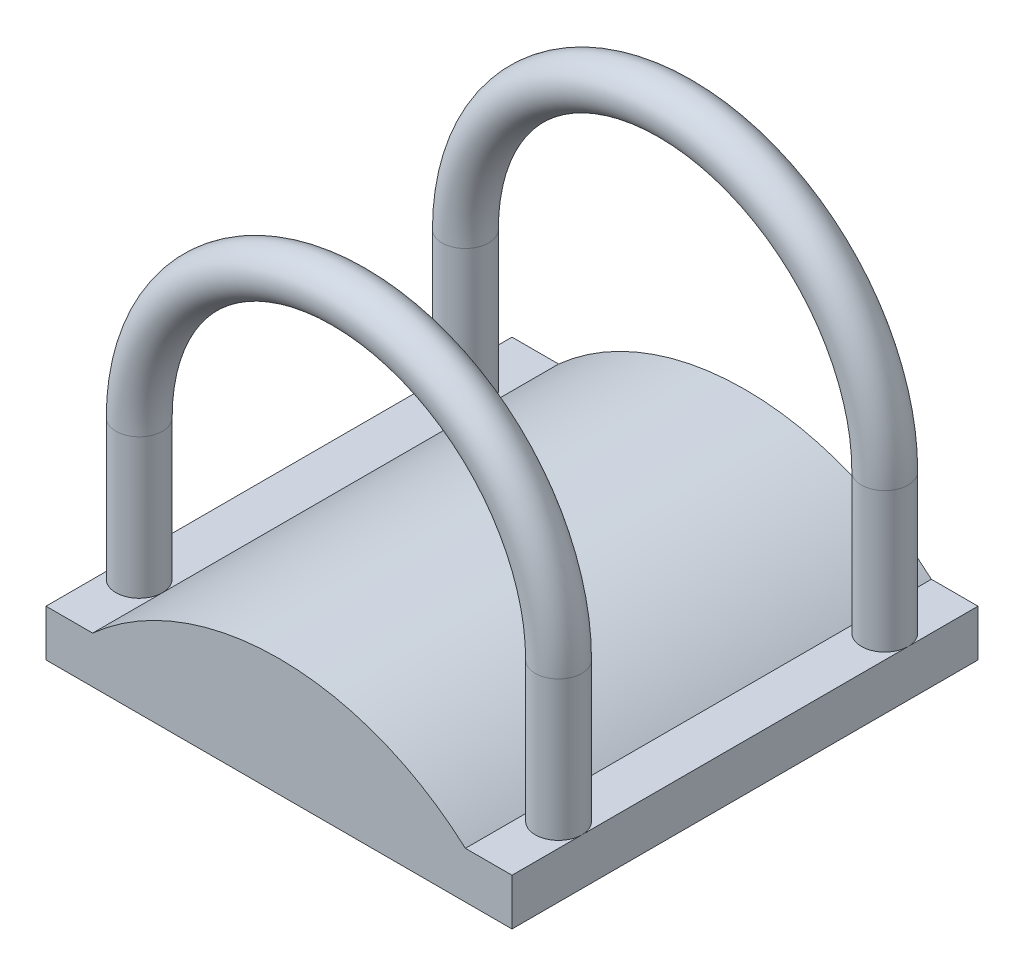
ISO-10303-21;
HEADER;
FILE_DESCRIPTION(('STEP AP214'),'2;1');
FILE_NAME('part.step','',(''),(''),'','','');
FILE_SCHEMA(('AUTOMOTIVE_DESIGN { 1 0 10303 214 1 1 1 1 }'));
ENDSEC;
DATA;
#1=APPLICATION_CONTEXT('core data for automotive mechanical design processes');
#2=APPLICATION_PROTOCOL_DEFINITION('international standard','automotive_design',2000,#1);
#3=PRODUCT_CONTEXT('',#1,'mechanical');
#4=PRODUCT('Part','Part','',(#3));
#5=PRODUCT_RELATED_PRODUCT_CATEGORY('part','',(#4));
#6=PRODUCT_DEFINITION_FORMATION('','',#4);
#7=PRODUCT_DEFINITION_CONTEXT('part definition',#1,'design');
#8=PRODUCT_DEFINITION('design','',#6,#7);
#9=PRODUCT_DEFINITION_SHAPE('','',#8);
#10=(LENGTH_UNIT() NAMED_UNIT(*) SI_UNIT(.MILLI.,.METRE.));
#11=(NAMED_UNIT(*) PLANE_ANGLE_UNIT() SI_UNIT($,.RADIAN.));
#12=(NAMED_UNIT(*) SI_UNIT($,.STERADIAN.) SOLID_ANGLE_UNIT());
#13=UNCERTAINTY_MEASURE_WITH_UNIT(LENGTH_MEASURE(1.E-05),#10,'distance_accuracy_value','');
#14=(GEOMETRIC_REPRESENTATION_CONTEXT(3) GLOBAL_UNCERTAINTY_ASSIGNED_CONTEXT((#13)) GLOBAL_UNIT_ASSIGNED_CONTEXT((#10,
#11,#12)) REPRESENTATION_CONTEXT('',''));
#15=CARTESIAN_POINT('',(0.,0.,0.));
#16=DIRECTION('',(0.,0.,1.));
#17=DIRECTION('',(1.,0.,0.));
#18=AXIS2_PLACEMENT_3D('',#15,#16,#17);
#19=CARTESIAN_POINT('',(0.,10.,50.));
#20=DIRECTION('',(0.,-1.,0.));
#21=DIRECTION('',(1.,0.,0.));
#22=AXIS2_PLACEMENT_3D('',#19,#20,#21);
#23=PLANE('',#22);
#24=CARTESIAN_POINT('',(-5.00000000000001,10.,-35.));
#25=DIRECTION('',(0.,1.,0.));
#26=DIRECTION('',(-1.,0.,0.));
#27=AXIS2_PLACEMENT_3D('',#24,#25,#26);
#28=CIRCLE('',#27,5.);
#29=CARTESIAN_POINT('',(0.,10.,-35.));
#30=VERTEX_POINT('',#29);
#31=CARTESIAN_POINT('',(-9.99999999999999,9.99999999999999,-35.));
#32=VERTEX_POINT('',#31);
#33=EDGE_CURVE('E220',#30,#32,#28,.T.);
#34=ORIENTED_EDGE('',*,*,#33,.F.);
#35=DIRECTION('',(0.,0.,-1.));
#36=VECTOR('',#35,1.);
#37=CARTESIAN_POINT('',(0.,10.,50.));
#38=LINE('',#37,#36);
#39=CARTESIAN_POINT('',(0.,10.,-50.));
#40=VERTEX_POINT('',#39);
#41=EDGE_CURVE('E42',#30,#40,#38,.T.);
#42=ORIENTED_EDGE('',*,*,#41,.T.);
#43=DIRECTION('',(-1.,0.,0.));
#44=VECTOR('',#43,1.);
#45=CARTESIAN_POINT('',(0.,10.,-50.));
#46=LINE('',#45,#44);
#47=CARTESIAN_POINT('',(-9.99999999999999,9.99999999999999,-50.));
#48=VERTEX_POINT('',#47);
#49=EDGE_CURVE('E162',#40,#48,#46,.T.);
#50=ORIENTED_EDGE('',*,*,#49,.T.);
#51=DIRECTION('',(0.,0.,-1.));
#52=VECTOR('',#51,1.);
#53=CARTESIAN_POINT('',(-9.99999999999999,9.99999999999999,50.));
#54=LINE('',#53,#52);
#55=EDGE_CURVE('E146',#32,#48,#54,.T.);
#56=ORIENTED_EDGE('',*,*,#55,.F.);
#57=EDGE_LOOP('',(#34,#42,#50,#56));
#58=FACE_BOUND('',#57,.T.);
#59=ADVANCED_FACE('F33',(#58),#23,.F.);
#60=EDGE_CURVE('E49',#32,#30,#28,.T.);
#61=ORIENTED_EDGE('',*,*,#60,.F.);
#62=CARTESIAN_POINT('',(-10.,10.,35.));
#63=VERTEX_POINT('',#62);
#64=EDGE_CURVE('E148',#63,#32,#54,.T.);
#65=ORIENTED_EDGE('',*,*,#64,.F.);
#66=CARTESIAN_POINT('',(-5.,10.,35.));
#67=DIRECTION('',(0.,1.,0.));
#68=DIRECTION('',(-1.,0.,0.));
#69=AXIS2_PLACEMENT_3D('',#66,#67,#68);
#70=CIRCLE('',#69,5.);
#71=CARTESIAN_POINT('',(0.,10.,35.));
#72=VERTEX_POINT('',#71);
#73=EDGE_CURVE('E126',#72,#63,#70,.T.);
#74=ORIENTED_EDGE('',*,*,#73,.F.);
#75=EDGE_CURVE('E41',#72,#30,#38,.T.);
#76=ORIENTED_EDGE('',*,*,#75,.T.);
#77=EDGE_LOOP('',(#61,#65,#74,#76));
#78=FACE_BOUND('',#77,.T.);
#79=ADVANCED_FACE('F234',(#78),#23,.F.);
#80=CARTESIAN_POINT('',(-100.,10.,50.));
#81=DIRECTION('',(0.,-1.,0.));
#82=DIRECTION('',(0.,0.,-1.));
#83=AXIS2_PLACEMENT_3D('',#80,#81,#82);
#84=PLANE('',#83);
#85=DIRECTION('',(0.,0.,-1.));
#86=VECTOR('',#85,1.);
#87=CARTESIAN_POINT('',(-90.,10.,50.));
#88=LINE('',#87,#86);
#89=CARTESIAN_POINT('',(-90.,10.,35.));
#90=VERTEX_POINT('',#89);
#91=CARTESIAN_POINT('',(-90.,10.,-35.));
#92=VERTEX_POINT('',#91);
#93=EDGE_CURVE('E125',#90,#92,#88,.T.);
#94=ORIENTED_EDGE('',*,*,#93,.T.);
#95=CARTESIAN_POINT('',(-95.,9.99999999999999,-35.));
#96=DIRECTION('',(0.,-1.,0.));
#97=DIRECTION('',(1.,0.,0.));
#98=AXIS2_PLACEMENT_3D('',#95,#96,#97);
#99=CIRCLE('',#98,5.);
#100=CARTESIAN_POINT('',(-100.,9.99999999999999,-35.));
#101=VERTEX_POINT('',#100);
#102=EDGE_CURVE('E56',#92,#101,#99,.T.);
#103=ORIENTED_EDGE('',*,*,#102,.T.);
#104=DIRECTION('',(0.,0.,-1.));
#105=VECTOR('',#104,1.);
#106=CARTESIAN_POINT('',(-100.,10.,50.));
#107=LINE('',#106,#105);
#108=CARTESIAN_POINT('',(-100.,9.99999999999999,35.));
#109=VERTEX_POINT('',#108);
#110=EDGE_CURVE('E122',#109,#101,#107,.T.);
#111=ORIENTED_EDGE('',*,*,#110,.F.);
#112=CARTESIAN_POINT('',(-95.,9.99999999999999,35.));
#113=DIRECTION('',(0.,-1.,0.));
#114=DIRECTION('',(1.,0.,0.));
#115=AXIS2_PLACEMENT_3D('',#112,#113,#114);
#116=CIRCLE('',#115,5.);
#117=EDGE_CURVE('E203',#109,#90,#116,.T.);
#118=ORIENTED_EDGE('',*,*,#117,.T.);
#119=EDGE_LOOP('',(#94,#103,#111,#118));
#120=FACE_BOUND('',#119,.T.);
#121=ADVANCED_FACE('F119',(#120),#84,.F.);
#122=EDGE_CURVE('E212',#63,#72,#70,.T.);
#123=ORIENTED_EDGE('',*,*,#122,.F.);
#124=CARTESIAN_POINT('',(-9.99999999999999,9.99999999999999,50.));
#125=VERTEX_POINT('',#124);
#126=EDGE_CURVE('E147',#125,#63,#54,.T.);
#127=ORIENTED_EDGE('',*,*,#126,.F.);
#128=DIRECTION('',(-1.,0.,0.));
#129=VECTOR('',#128,1.);
#130=CARTESIAN_POINT('',(0.,10.,50.));
#131=LINE('',#130,#129);
#132=CARTESIAN_POINT('',(0.,10.,50.));
#133=VERTEX_POINT('',#132);
#134=EDGE_CURVE('E181',#133,#125,#131,.T.);
#135=ORIENTED_EDGE('',*,*,#134,.F.);
#136=EDGE_CURVE('E11',#133,#72,#38,.T.);
#137=ORIENTED_EDGE('',*,*,#136,.T.);
#138=EDGE_LOOP('',(#123,#127,#135,#137));
#139=FACE_BOUND('',#138,.T.);
#140=ADVANCED_FACE('F235',(#139),#23,.F.);
#141=CARTESIAN_POINT('',(-90.,10.,50.));
#142=VERTEX_POINT('',#141);
#143=EDGE_CURVE('E144',#142,#90,#88,.T.);
#144=ORIENTED_EDGE('',*,*,#143,.T.);
#145=EDGE_CURVE('E201',#90,#109,#116,.T.);
#146=ORIENTED_EDGE('',*,*,#145,.T.);
#147=CARTESIAN_POINT('',(-100.,10.,50.));
#148=VERTEX_POINT('',#147);
#149=EDGE_CURVE('E136',#148,#109,#107,.T.);
#150=ORIENTED_EDGE('',*,*,#149,.F.);
#151=DIRECTION('',(-1.,0.,0.));
#152=VECTOR('',#151,1.);
#153=CARTESIAN_POINT('',(-100.,10.,50.));
#154=LINE('',#153,#152);
#155=EDGE_CURVE('E185',#142,#148,#154,.T.);
#156=ORIENTED_EDGE('',*,*,#155,.F.);
#157=EDGE_LOOP('',(#144,#146,#150,#156));
#158=FACE_BOUND('',#157,.T.);
#159=ADVANCED_FACE('F241',(#158),#84,.F.);
#160=CARTESIAN_POINT('',(0.,10.,50.));
#161=DIRECTION('',(-1.,0.,0.));
#162=DIRECTION('',(0.,-1.,0.));
#163=AXIS2_PLACEMENT_3D('',#160,#161,#162);
#164=PLANE('',#163);
#165=DIRECTION('',(0.,1.,0.));
#166=VECTOR('',#165,1.);
#167=CARTESIAN_POINT('',(0.,10.,-50.));
#168=LINE('',#167,#166);
#169=CARTESIAN_POINT('',(0.,0.,-50.));
#170=VERTEX_POINT('',#169);
#171=EDGE_CURVE('E167',#170,#40,#168,.T.);
#172=ORIENTED_EDGE('',*,*,#171,.T.);
#173=ORIENTED_EDGE('',*,*,#41,.F.);
#174=ORIENTED_EDGE('',*,*,#75,.F.);
#175=ORIENTED_EDGE('',*,*,#136,.F.);
#176=DIRECTION('',(0.,1.,0.));
#177=VECTOR('',#176,1.);
#178=CARTESIAN_POINT('',(0.,10.,50.));
#179=LINE('',#178,#177);
#180=CARTESIAN_POINT('',(0.,0.,50.));
#181=VERTEX_POINT('',#180);
#182=EDGE_CURVE('E178',#181,#133,#179,.T.);
#183=ORIENTED_EDGE('',*,*,#182,.F.);
#184=DIRECTION('',(0.,0.,-1.));
#185=VECTOR('',#184,1.);
#186=CARTESIAN_POINT('',(0.,0.,50.));
#187=LINE('',#186,#185);
#188=EDGE_CURVE('E190',#181,#170,#187,.T.);
#189=ORIENTED_EDGE('',*,*,#188,.T.);
#190=EDGE_LOOP('',(#172,#173,#174,#175,#183,#189));
#191=FACE_BOUND('',#190,.T.);
#192=ADVANCED_FACE('F35',(#191),#164,.F.);
#193=CARTESIAN_POINT('',(-50.,-34.7213595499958,50.));
#194=DIRECTION('',(0.,0.,-1.));
#195=DIRECTION('',(-1.,0.,0.));
#196=AXIS2_PLACEMENT_3D('',#193,#194,#195);
#197=CYLINDRICAL_SURFACE('',#196,60.);
#198=CARTESIAN_POINT('',(-50.,-34.7213595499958,-50.));
#199=DIRECTION('',(0.,0.,1.));
#200=DIRECTION('',(-1.,0.,0.));
#201=AXIS2_PLACEMENT_3D('',#198,#199,#200);
#202=CIRCLE('',#201,60.);
#203=CARTESIAN_POINT('',(-90.,10.,-50.));
#204=VERTEX_POINT('',#203);
#205=EDGE_CURVE('E157',#48,#204,#202,.T.);
#206=ORIENTED_EDGE('',*,*,#205,.T.);
#207=EDGE_CURVE('E140',#92,#204,#88,.T.);
#208=ORIENTED_EDGE('',*,*,#207,.F.);
#209=ORIENTED_EDGE('',*,*,#93,.F.);
#210=ORIENTED_EDGE('',*,*,#143,.F.);
#211=CARTESIAN_POINT('',(-50.,-34.7213595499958,50.));
#212=DIRECTION('',(0.,0.,1.));
#213=DIRECTION('',(-1.,0.,0.));
#214=AXIS2_PLACEMENT_3D('',#211,#212,#213);
#215=CIRCLE('',#214,60.);
#216=EDGE_CURVE('E183',#125,#142,#215,.T.);
#217=ORIENTED_EDGE('',*,*,#216,.F.);
#218=ORIENTED_EDGE('',*,*,#126,.T.);
#219=ORIENTED_EDGE('',*,*,#64,.T.);
#220=ORIENTED_EDGE('',*,*,#55,.T.);
#221=EDGE_LOOP('',(#206,#208,#209,#210,#217,#218,#219,#220));
#222=FACE_BOUND('',#221,.T.);
#223=ADVANCED_FACE('F155',(#222),#197,.T.);
#224=CARTESIAN_POINT('',(-100.,10.,-50.));
#225=VERTEX_POINT('',#224);
#226=EDGE_CURVE('E128',#101,#225,#107,.T.);
#227=ORIENTED_EDGE('',*,*,#226,.F.);
#228=EDGE_CURVE('E109',#101,#92,#99,.T.);
#229=ORIENTED_EDGE('',*,*,#228,.T.);
#230=ORIENTED_EDGE('',*,*,#207,.T.);
#231=DIRECTION('',(-1.,0.,0.));
#232=VECTOR('',#231,1.);
#233=CARTESIAN_POINT('',(-100.,10.,-50.));
#234=LINE('',#233,#232);
#235=EDGE_CURVE('E131',#204,#225,#234,.T.);
#236=ORIENTED_EDGE('',*,*,#235,.T.);
#237=EDGE_LOOP('',(#227,#229,#230,#236));
#238=FACE_BOUND('',#237,.T.);
#239=ADVANCED_FACE('F129',(#238),#84,.F.);
#240=CARTESIAN_POINT('',(-100.,0.,50.));
#241=DIRECTION('',(1.,0.,0.));
#242=DIRECTION('',(0.,0.,-1.));
#243=AXIS2_PLACEMENT_3D('',#240,#241,#242);
#244=PLANE('',#243);
#245=DIRECTION('',(0.,-1.,0.));
#246=VECTOR('',#245,1.);
#247=CARTESIAN_POINT('',(-100.,0.,-50.));
#248=LINE('',#247,#246);
#249=CARTESIAN_POINT('',(-100.,0.,-50.));
#250=VERTEX_POINT('',#249);
#251=EDGE_CURVE('E171',#225,#250,#248,.T.);
#252=ORIENTED_EDGE('',*,*,#251,.T.);
#253=DIRECTION('',(0.,0.,-1.));
#254=VECTOR('',#253,1.);
#255=CARTESIAN_POINT('',(-100.,0.,50.));
#256=LINE('',#255,#254);
#257=CARTESIAN_POINT('',(-100.,0.,50.));
#258=VERTEX_POINT('',#257);
#259=EDGE_CURVE('E134',#258,#250,#256,.T.);
#260=ORIENTED_EDGE('',*,*,#259,.F.);
#261=DIRECTION('',(0.,-1.,0.));
#262=VECTOR('',#261,1.);
#263=CARTESIAN_POINT('',(-100.,0.,50.));
#264=LINE('',#263,#262);
#265=EDGE_CURVE('E187',#148,#258,#264,.T.);
#266=ORIENTED_EDGE('',*,*,#265,.F.);
#267=ORIENTED_EDGE('',*,*,#149,.T.);
#268=ORIENTED_EDGE('',*,*,#110,.T.);
#269=ORIENTED_EDGE('',*,*,#226,.T.);
#270=EDGE_LOOP('',(#252,#260,#266,#267,#268,#269));
#271=FACE_BOUND('',#270,.T.);
#272=ADVANCED_FACE('F137',(#271),#244,.F.);
#273=CARTESIAN_POINT('',(0.,0.,50.));
#274=DIRECTION('',(0.,1.,0.));
#275=DIRECTION('',(-1.,0.,0.));
#276=AXIS2_PLACEMENT_3D('',#273,#274,#275);
#277=PLANE('',#276);
#278=DIRECTION('',(1.,0.,0.));
#279=VECTOR('',#278,1.);
#280=CARTESIAN_POINT('',(0.,0.,-50.));
#281=LINE('',#280,#279);
#282=EDGE_CURVE('E176',#250,#170,#281,.T.);
#283=ORIENTED_EDGE('',*,*,#282,.T.);
#284=ORIENTED_EDGE('',*,*,#188,.F.);
#285=DIRECTION('',(1.,0.,0.));
#286=VECTOR('',#285,1.);
#287=CARTESIAN_POINT('',(0.,0.,50.));
#288=LINE('',#287,#286);
#289=EDGE_CURVE('E189',#258,#181,#288,.T.);
#290=ORIENTED_EDGE('',*,*,#289,.F.);
#291=ORIENTED_EDGE('',*,*,#259,.T.);
#292=EDGE_LOOP('',(#283,#284,#290,#291));
#293=FACE_BOUND('',#292,.T.);
#294=ADVANCED_FACE('F200',(#293),#277,.F.);
#295=CARTESIAN_POINT('',(-50.,-34.7213595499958,50.));
#296=DIRECTION('',(0.,0.,-1.));
#297=DIRECTION('',(-1.,0.,0.));
#298=AXIS2_PLACEMENT_3D('',#295,#296,#297);
#299=PLANE('',#298);
#300=ORIENTED_EDGE('',*,*,#182,.T.);
#301=ORIENTED_EDGE('',*,*,#134,.T.);
#302=ORIENTED_EDGE('',*,*,#216,.T.);
#303=ORIENTED_EDGE('',*,*,#155,.T.);
#304=ORIENTED_EDGE('',*,*,#265,.T.);
#305=ORIENTED_EDGE('',*,*,#289,.T.);
#306=EDGE_LOOP('',(#300,#301,#302,#303,#304,#305));
#307=FACE_BOUND('',#306,.T.);
#308=ADVANCED_FACE('F256',(#307),#299,.F.);
#309=CARTESIAN_POINT('',(-50.,-34.7213595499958,-50.));
#310=DIRECTION('',(0.,0.,-1.));
#311=DIRECTION('',(-1.,0.,0.));
#312=AXIS2_PLACEMENT_3D('',#309,#310,#311);
#313=PLANE('',#312);
#314=ORIENTED_EDGE('',*,*,#171,.F.);
#315=ORIENTED_EDGE('',*,*,#282,.F.);
#316=ORIENTED_EDGE('',*,*,#251,.F.);
#317=ORIENTED_EDGE('',*,*,#235,.F.);
#318=ORIENTED_EDGE('',*,*,#205,.F.);
#319=ORIENTED_EDGE('',*,*,#49,.F.);
#320=EDGE_LOOP('',(#314,#315,#316,#317,#318,#319));
#321=FACE_BOUND('',#320,.T.);
#322=ADVANCED_FACE('F169',(#321),#313,.T.);
#323=CARTESIAN_POINT('',(-95.,40.,35.));
#324=DIRECTION('',(0.,-1.,0.));
#325=DIRECTION('',(0.,0.,-1.));
#326=AXIS2_PLACEMENT_3D('',#323,#324,#325);
#327=CYLINDRICAL_SURFACE('',#326,5.);
#328=CARTESIAN_POINT('',(-95.,40.,35.));
#329=DIRECTION('',(0.,-1.,0.));
#330=DIRECTION('',(1.,0.,0.));
#331=AXIS2_PLACEMENT_3D('',#328,#329,#330);
#332=CIRCLE('',#331,5.);
#333=CARTESIAN_POINT('',(-100.,40.,35.));
#334=VERTEX_POINT('',#333);
#335=EDGE_CURVE('E206',#334,#334,#332,.T.);
#336=ORIENTED_EDGE('',*,*,#335,.T.);
#337=EDGE_LOOP('',(#336));
#338=FACE_BOUND('',#337,.T.);
#339=ORIENTED_EDGE('',*,*,#145,.F.);
#340=ORIENTED_EDGE('',*,*,#117,.F.);
#341=EDGE_LOOP('',(#339,#340));
#342=FACE_BOUND('',#341,.T.);
#343=ADVANCED_FACE('F260',(#338,#342),#327,.T.);
#344=CARTESIAN_POINT('',(-50.,40.,35.));
#345=DIRECTION('',(0.,0.,1.));
#346=DIRECTION('',(1.,0.,0.));
#347=AXIS2_PLACEMENT_3D('',#344,#345,#346);
#348=TOROIDAL_SURFACE('',#347,45.,5.);
#349=CARTESIAN_POINT('',(-5.,40.,35.));
#350=DIRECTION('',(0.,1.,0.));
#351=DIRECTION('',(-1.,0.,0.));
#352=AXIS2_PLACEMENT_3D('',#349,#350,#351);
#353=CIRCLE('',#352,5.);
#354=CARTESIAN_POINT('',(0.,40.,35.));
#355=VERTEX_POINT('',#354);
#356=EDGE_CURVE('E209',#355,#355,#353,.T.);
#357=CARTESIAN_POINT('',(-50.,40.,35.));
#358=DIRECTION('',(0.,0.,1.));
#359=DIRECTION('',(1.,0.,0.));
#360=AXIS2_PLACEMENT_3D('',#357,#358,#359);
#361=CIRCLE('',#360,50.);
#362=EDGE_CURVE('',#355,#334,#361,.T.);
#363=ORIENTED_EDGE('',*,*,#356,.T.);
#364=ORIENTED_EDGE('',*,*,#335,.F.);
#365=ORIENTED_EDGE('',*,*,#362,.T.);
#366=ORIENTED_EDGE('',*,*,#362,.F.);
#367=EDGE_LOOP('',(#363,#365,#364,#366));
#368=FACE_BOUND('',#367,.T.);
#369=ADVANCED_FACE('F262',(#368),#348,.T.);
#370=CARTESIAN_POINT('',(-5.,40.,35.));
#371=DIRECTION('',(0.,-1.,0.));
#372=DIRECTION('',(1.,0.,0.));
#373=AXIS2_PLACEMENT_3D('',#370,#371,#372);
#374=CYLINDRICAL_SURFACE('',#373,5.);
#375=ORIENTED_EDGE('',*,*,#356,.F.);
#376=EDGE_LOOP('',(#375));
#377=FACE_BOUND('',#376,.T.);
#378=ORIENTED_EDGE('',*,*,#122,.T.);
#379=ORIENTED_EDGE('',*,*,#73,.T.);
#380=EDGE_LOOP('',(#378,#379));
#381=FACE_BOUND('',#380,.T.);
#382=ADVANCED_FACE('F253',(#377,#381),#374,.T.);
#383=CARTESIAN_POINT('',(-95.,40.,-35.));
#384=DIRECTION('',(0.,-1.,0.));
#385=DIRECTION('',(0.,0.,-1.));
#386=AXIS2_PLACEMENT_3D('',#383,#384,#385);
#387=CYLINDRICAL_SURFACE('',#386,5.);
#388=CARTESIAN_POINT('',(-95.,40.,-35.));
#389=DIRECTION('',(0.,-1.,0.));
#390=DIRECTION('',(1.,0.,0.));
#391=AXIS2_PLACEMENT_3D('',#388,#389,#390);
#392=CIRCLE('',#391,5.);
#393=CARTESIAN_POINT('',(-100.,40.,-35.));
#394=VERTEX_POINT('',#393);
#395=EDGE_CURVE('E114',#394,#394,#392,.T.);
#396=ORIENTED_EDGE('',*,*,#395,.T.);
#397=EDGE_LOOP('',(#396));
#398=FACE_BOUND('',#397,.T.);
#399=ORIENTED_EDGE('',*,*,#102,.F.);
#400=ORIENTED_EDGE('',*,*,#228,.F.);
#401=EDGE_LOOP('',(#399,#400));
#402=FACE_BOUND('',#401,.T.);
#403=ADVANCED_FACE('F110',(#398,#402),#387,.T.);
#404=CARTESIAN_POINT('',(-50.,40.,-35.));
#405=DIRECTION('',(0.,0.,1.));
#406=DIRECTION('',(1.,0.,0.));
#407=AXIS2_PLACEMENT_3D('',#404,#405,#406);
#408=TOROIDAL_SURFACE('',#407,45.,5.);
#409=CARTESIAN_POINT('',(-5.00000000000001,40.,-35.));
#410=DIRECTION('',(0.,1.,0.));
#411=DIRECTION('',(-1.,0.,0.));
#412=AXIS2_PLACEMENT_3D('',#409,#410,#411);
#413=CIRCLE('',#412,5.);
#414=CARTESIAN_POINT('',(0.,40.,-35.));
#415=VERTEX_POINT('',#414);
#416=EDGE_CURVE('E217',#415,#415,#413,.T.);
#417=CARTESIAN_POINT('',(-50.,40.,-35.));
#418=DIRECTION('',(0.,0.,1.));
#419=DIRECTION('',(1.,0.,0.));
#420=AXIS2_PLACEMENT_3D('',#417,#418,#419);
#421=CIRCLE('',#420,50.);
#422=EDGE_CURVE('',#415,#394,#421,.T.);
#423=ORIENTED_EDGE('',*,*,#416,.T.);
#424=ORIENTED_EDGE('',*,*,#395,.F.);
#425=ORIENTED_EDGE('',*,*,#422,.T.);
#426=ORIENTED_EDGE('',*,*,#422,.F.);
#427=EDGE_LOOP('',(#423,#425,#424,#426));
#428=FACE_BOUND('',#427,.T.);
#429=ADVANCED_FACE('F224',(#428),#408,.T.);
#430=CARTESIAN_POINT('',(-5.00000000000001,40.,-35.));
#431=DIRECTION('',(0.,-1.,0.));
#432=DIRECTION('',(1.,0.,0.));
#433=AXIS2_PLACEMENT_3D('',#430,#431,#432);
#434=CYLINDRICAL_SURFACE('',#433,5.);
#435=ORIENTED_EDGE('',*,*,#416,.F.);
#436=EDGE_LOOP('',(#435));
#437=FACE_BOUND('',#436,.T.);
#438=ORIENTED_EDGE('',*,*,#60,.T.);
#439=ORIENTED_EDGE('',*,*,#33,.T.);
#440=EDGE_LOOP('',(#438,#439));
#441=FACE_BOUND('',#440,.T.);
#442=ADVANCED_FACE('F222',(#437,#441),#434,.T.);
#443=CLOSED_SHELL('',(#59,#79,#121,#140,#159,#192,#223,#239,#272,#294,#308,#322,#343,#369,#382,
#403,#429,#442));
#444=MANIFOLD_SOLID_BREP('B2',#443);
#445=ADVANCED_BREP_SHAPE_REPRESENTATION('',(#18,#444),#14);
#446=SHAPE_DEFINITION_REPRESENTATION(#9,#445);
ENDSEC;
END-ISO-10303-21;
